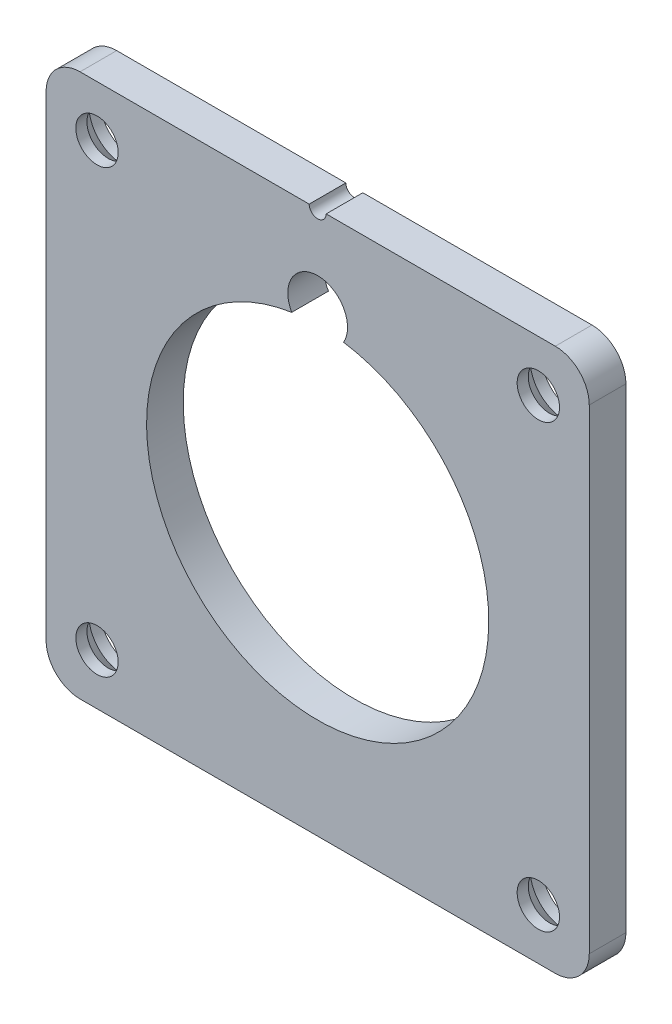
ISO-10303-21;
HEADER;
FILE_DESCRIPTION(('STEP AP214'),'2;1');
FILE_NAME('part.step','',(''),(''),'','','');
FILE_SCHEMA(('AUTOMOTIVE_DESIGN { 1 0 10303 214 1 1 1 1 }'));
ENDSEC;
DATA;
#1=APPLICATION_CONTEXT('core data for automotive mechanical design processes');
#2=APPLICATION_PROTOCOL_DEFINITION('international standard','automotive_design',2000,#1);
#3=PRODUCT_CONTEXT('',#1,'mechanical');
#4=PRODUCT('Part','Part','',(#3));
#5=PRODUCT_RELATED_PRODUCT_CATEGORY('part','',(#4));
#6=PRODUCT_DEFINITION_FORMATION('','',#4);
#7=PRODUCT_DEFINITION_CONTEXT('part definition',#1,'design');
#8=PRODUCT_DEFINITION('design','',#6,#7);
#9=PRODUCT_DEFINITION_SHAPE('','',#8);
#10=(LENGTH_UNIT() NAMED_UNIT(*) SI_UNIT(.MILLI.,.METRE.));
#11=(NAMED_UNIT(*) PLANE_ANGLE_UNIT() SI_UNIT($,.RADIAN.));
#12=(NAMED_UNIT(*) SI_UNIT($,.STERADIAN.) SOLID_ANGLE_UNIT());
#13=UNCERTAINTY_MEASURE_WITH_UNIT(LENGTH_MEASURE(1.E-05),#10,'distance_accuracy_value','');
#14=(GEOMETRIC_REPRESENTATION_CONTEXT(3) GLOBAL_UNCERTAINTY_ASSIGNED_CONTEXT((#13)) GLOBAL_UNIT_ASSIGNED_CONTEXT((#10,
#11,#12)) REPRESENTATION_CONTEXT('',''));
#15=CARTESIAN_POINT('',(0.,0.,0.));
#16=DIRECTION('',(0.,0.,1.));
#17=DIRECTION('',(1.,0.,0.));
#18=AXIS2_PLACEMENT_3D('',#15,#16,#17);
#19=CARTESIAN_POINT('',(-50.8,50.8,6.858));
#20=DIRECTION('',(0.,-1.,0.));
#21=DIRECTION('',(0.,0.,-1.));
#22=AXIS2_PLACEMENT_3D('',#19,#20,#21);
#23=PLANE('',#22);
#24=DIRECTION('',(-1.,0.,0.));
#25=VECTOR('',#24,1.);
#26=CARTESIAN_POINT('',(-50.8,50.8,6.858));
#27=LINE('',#26,#25);
#28=CARTESIAN_POINT('',(-1.5875,50.8,6.858));
#29=VERTEX_POINT('',#28);
#30=CARTESIAN_POINT('',(-44.45,50.8,6.858));
#31=VERTEX_POINT('',#30);
#32=EDGE_CURVE('E204',#29,#31,#27,.T.);
#33=ORIENTED_EDGE('',*,*,#32,.F.);
#34=DIRECTION('',(0.,0.,-1.));
#35=VECTOR('',#34,1.);
#36=CARTESIAN_POINT('',(-1.5875,50.8,6.858));
#37=LINE('',#36,#35);
#38=CARTESIAN_POINT('',(-1.5875,50.8,0.));
#39=VERTEX_POINT('',#38);
#40=EDGE_CURVE('E142',#29,#39,#37,.T.);
#41=ORIENTED_EDGE('',*,*,#40,.T.);
#42=DIRECTION('',(-1.,0.,0.));
#43=VECTOR('',#42,1.);
#44=CARTESIAN_POINT('',(-50.8,50.8,0.));
#45=LINE('',#44,#43);
#46=CARTESIAN_POINT('',(-44.45,50.8,0.));
#47=VERTEX_POINT('',#46);
#48=EDGE_CURVE('E217',#39,#47,#45,.T.);
#49=ORIENTED_EDGE('',*,*,#48,.T.);
#50=DIRECTION('',(0.,0.,-1.));
#51=VECTOR('',#50,1.);
#52=CARTESIAN_POINT('',(-44.45,50.8,6.858));
#53=LINE('',#52,#51);
#54=EDGE_CURVE('E251',#47,#31,#53,.F.);
#55=ORIENTED_EDGE('',*,*,#54,.T.);
#56=EDGE_LOOP('',(#33,#41,#49,#55));
#57=FACE_BOUND('',#56,.T.);
#58=ADVANCED_FACE('F32',(#57),#23,.F.);
#59=CARTESIAN_POINT('',(0.,0.,0.));
#60=DIRECTION('',(0.,0.,1.));
#61=DIRECTION('',(1.,0.,0.));
#62=AXIS2_PLACEMENT_3D('',#59,#60,#61);
#63=PLANE('',#62);
#64=CARTESIAN_POINT('',(0.,0.,0.));
#65=DIRECTION('',(0.,0.,-1.));
#66=DIRECTION('',(-1.,0.,0.));
#67=AXIS2_PLACEMENT_3D('',#64,#65,#66);
#68=CIRCLE('',#67,32.004);
#69=CARTESIAN_POINT('',(4.84622975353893,31.6349501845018,0.));
#70=VERTEX_POINT('',#69);
#71=CARTESIAN_POINT('',(-4.846229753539,31.6349501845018,0.));
#72=VERTEX_POINT('',#71);
#73=EDGE_CURVE('E131',#70,#72,#68,.T.);
#74=ORIENTED_EDGE('',*,*,#73,.F.);
#75=CARTESIAN_POINT('',(0.,34.417,0.));
#76=DIRECTION('',(0.,0.,-1.));
#77=DIRECTION('',(-1.,0.,0.));
#78=AXIS2_PLACEMENT_3D('',#75,#76,#77);
#79=CIRCLE('',#78,5.58799999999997);
#80=EDGE_CURVE('E47',#72,#70,#79,.T.);
#81=ORIENTED_EDGE('',*,*,#80,.F.);
#82=EDGE_LOOP('',(#74,#81));
#83=FACE_BOUND('',#82,.T.);
#84=CARTESIAN_POINT('',(41.275,41.275,0.));
#85=DIRECTION('',(0.,0.,-1.));
#86=DIRECTION('',(-1.,0.,0.));
#87=AXIS2_PLACEMENT_3D('',#84,#85,#86);
#88=CIRCLE('',#87,6.35);
#89=CARTESIAN_POINT('',(34.925,41.275,0.));
#90=VERTEX_POINT('',#89);
#91=EDGE_CURVE('E145',#90,#90,#88,.T.);
#92=ORIENTED_EDGE('',*,*,#91,.F.);
#93=EDGE_LOOP('',(#92));
#94=FACE_BOUND('',#93,.T.);
#95=CARTESIAN_POINT('',(-41.275,41.275,0.));
#96=DIRECTION('',(0.,0.,-1.));
#97=DIRECTION('',(-1.,0.,0.));
#98=AXIS2_PLACEMENT_3D('',#95,#96,#97);
#99=CIRCLE('',#98,6.35);
#100=CARTESIAN_POINT('',(-47.625,41.275,0.));
#101=VERTEX_POINT('',#100);
#102=EDGE_CURVE('E157',#101,#101,#99,.T.);
#103=ORIENTED_EDGE('',*,*,#102,.F.);
#104=EDGE_LOOP('',(#103));
#105=FACE_BOUND('',#104,.T.);
#106=CARTESIAN_POINT('',(41.275,-41.275,0.));
#107=DIRECTION('',(0.,0.,-1.));
#108=DIRECTION('',(-1.,0.,0.));
#109=AXIS2_PLACEMENT_3D('',#106,#107,#108);
#110=CIRCLE('',#109,6.35);
#111=CARTESIAN_POINT('',(34.925,-41.275,0.));
#112=VERTEX_POINT('',#111);
#113=EDGE_CURVE('E181',#112,#112,#110,.T.);
#114=ORIENTED_EDGE('',*,*,#113,.F.);
#115=EDGE_LOOP('',(#114));
#116=FACE_BOUND('',#115,.T.);
#117=ORIENTED_EDGE('',*,*,#48,.F.);
#118=CARTESIAN_POINT('',(0.,50.8,0.));
#119=DIRECTION('',(0.,0.,-1.));
#120=DIRECTION('',(-1.,0.,0.));
#121=AXIS2_PLACEMENT_3D('',#118,#119,#120);
#122=CIRCLE('',#121,1.5875);
#123=CARTESIAN_POINT('',(1.5875,50.8,0.));
#124=VERTEX_POINT('',#123);
#125=EDGE_CURVE('E136',#124,#39,#122,.T.);
#126=ORIENTED_EDGE('',*,*,#125,.F.);
#127=CARTESIAN_POINT('',(44.45,50.8,0.));
#128=VERTEX_POINT('',#127);
#129=EDGE_CURVE('E198',#128,#124,#45,.T.);
#130=ORIENTED_EDGE('',*,*,#129,.F.);
#131=CARTESIAN_POINT('',(44.45,44.45,0.));
#132=DIRECTION('',(0.,0.,1.));
#133=DIRECTION('',(1.,0.,0.));
#134=AXIS2_PLACEMENT_3D('',#131,#132,#133);
#135=CIRCLE('',#134,6.35);
#136=CARTESIAN_POINT('',(50.8,44.45,0.));
#137=VERTEX_POINT('',#136);
#138=EDGE_CURVE('E227',#128,#137,#135,.F.);
#139=ORIENTED_EDGE('',*,*,#138,.T.);
#140=DIRECTION('',(0.,1.,0.));
#141=VECTOR('',#140,1.);
#142=CARTESIAN_POINT('',(50.8,50.8,0.));
#143=LINE('',#142,#141);
#144=CARTESIAN_POINT('',(50.8,-44.45,0.));
#145=VERTEX_POINT('',#144);
#146=EDGE_CURVE('E214',#145,#137,#143,.T.);
#147=ORIENTED_EDGE('',*,*,#146,.F.);
#148=CARTESIAN_POINT('',(44.45,-44.45,0.));
#149=DIRECTION('',(0.,0.,1.));
#150=DIRECTION('',(1.,0.,0.));
#151=AXIS2_PLACEMENT_3D('',#148,#149,#150);
#152=CIRCLE('',#151,6.35);
#153=CARTESIAN_POINT('',(44.45,-50.8,0.));
#154=VERTEX_POINT('',#153);
#155=EDGE_CURVE('E229',#145,#154,#152,.F.);
#156=ORIENTED_EDGE('',*,*,#155,.T.);
#157=DIRECTION('',(1.,0.,0.));
#158=VECTOR('',#157,1.);
#159=CARTESIAN_POINT('',(-50.8,-50.8,0.));
#160=LINE('',#159,#158);
#161=CARTESIAN_POINT('',(-44.45,-50.8,0.));
#162=VERTEX_POINT('',#161);
#163=EDGE_CURVE('E211',#162,#154,#160,.T.);
#164=ORIENTED_EDGE('',*,*,#163,.F.);
#165=CARTESIAN_POINT('',(-44.45,-44.45,0.));
#166=DIRECTION('',(0.,0.,1.));
#167=DIRECTION('',(1.,0.,0.));
#168=AXIS2_PLACEMENT_3D('',#165,#166,#167);
#169=CIRCLE('',#168,6.35);
#170=CARTESIAN_POINT('',(-50.8,-44.45,0.));
#171=VERTEX_POINT('',#170);
#172=EDGE_CURVE('E231',#162,#171,#169,.F.);
#173=ORIENTED_EDGE('',*,*,#172,.T.);
#174=DIRECTION('',(0.,-1.,0.));
#175=VECTOR('',#174,1.);
#176=CARTESIAN_POINT('',(-50.8,50.8,0.));
#177=LINE('',#176,#175);
#178=CARTESIAN_POINT('',(-50.8,44.45,0.));
#179=VERTEX_POINT('',#178);
#180=EDGE_CURVE('E193',#179,#171,#177,.T.);
#181=ORIENTED_EDGE('',*,*,#180,.F.);
#182=CARTESIAN_POINT('',(-44.45,44.45,0.));
#183=DIRECTION('',(0.,0.,1.));
#184=DIRECTION('',(1.,0.,0.));
#185=AXIS2_PLACEMENT_3D('',#182,#183,#184);
#186=CIRCLE('',#185,6.35);
#187=EDGE_CURVE('E224',#179,#47,#186,.F.);
#188=ORIENTED_EDGE('',*,*,#187,.T.);
#189=EDGE_LOOP('',(#117,#126,#130,#139,#147,#156,#164,#173,#181,#188));
#190=FACE_BOUND('',#189,.T.);
#191=CARTESIAN_POINT('',(-41.275,-41.275,0.));
#192=DIRECTION('',(0.,0.,-1.));
#193=DIRECTION('',(-1.,0.,0.));
#194=AXIS2_PLACEMENT_3D('',#191,#192,#193);
#195=CIRCLE('',#194,6.35);
#196=CARTESIAN_POINT('',(-47.625,-41.275,0.));
#197=VERTEX_POINT('',#196);
#198=EDGE_CURVE('E169',#197,#197,#195,.T.);
#199=ORIENTED_EDGE('',*,*,#198,.F.);
#200=EDGE_LOOP('',(#199));
#201=FACE_BOUND('',#200,.T.);
#202=ADVANCED_FACE('F264',(#83,#94,#105,#116,#190,#201),#63,.F.);
#203=CARTESIAN_POINT('',(-50.8,50.8,6.858));
#204=DIRECTION('',(1.,0.,0.));
#205=DIRECTION('',(0.,1.,0.));
#206=AXIS2_PLACEMENT_3D('',#203,#204,#205);
#207=PLANE('',#206);
#208=ORIENTED_EDGE('',*,*,#180,.T.);
#209=DIRECTION('',(0.,0.,-1.));
#210=VECTOR('',#209,1.);
#211=CARTESIAN_POINT('',(-50.8,-44.45,6.858));
#212=LINE('',#211,#210);
#213=CARTESIAN_POINT('',(-50.8,-44.45,6.858));
#214=VERTEX_POINT('',#213);
#215=EDGE_CURVE('E236',#171,#214,#212,.F.);
#216=ORIENTED_EDGE('',*,*,#215,.T.);
#217=DIRECTION('',(0.,-1.,0.));
#218=VECTOR('',#217,1.);
#219=CARTESIAN_POINT('',(-50.8,50.8,6.858));
#220=LINE('',#219,#218);
#221=CARTESIAN_POINT('',(-50.8,44.45,6.858));
#222=VERTEX_POINT('',#221);
#223=EDGE_CURVE('E194',#222,#214,#220,.T.);
#224=ORIENTED_EDGE('',*,*,#223,.F.);
#225=DIRECTION('',(0.,0.,-1.));
#226=VECTOR('',#225,1.);
#227=CARTESIAN_POINT('',(-50.8,44.45,6.858));
#228=LINE('',#227,#226);
#229=EDGE_CURVE('E233',#222,#179,#228,.T.);
#230=ORIENTED_EDGE('',*,*,#229,.T.);
#231=EDGE_LOOP('',(#208,#216,#224,#230));
#232=FACE_BOUND('',#231,.T.);
#233=ADVANCED_FACE('F297',(#232),#207,.F.);
#234=CARTESIAN_POINT('',(-50.8,-50.8,6.858));
#235=DIRECTION('',(0.,1.,0.));
#236=DIRECTION('',(0.,0.,1.));
#237=AXIS2_PLACEMENT_3D('',#234,#235,#236);
#238=PLANE('',#237);
#239=DIRECTION('',(1.,0.,0.));
#240=VECTOR('',#239,1.);
#241=CARTESIAN_POINT('',(-50.8,-50.8,6.858));
#242=LINE('',#241,#240);
#243=CARTESIAN_POINT('',(-44.45,-50.8,6.858));
#244=VERTEX_POINT('',#243);
#245=CARTESIAN_POINT('',(44.45,-50.8,6.858));
#246=VERTEX_POINT('',#245);
#247=EDGE_CURVE('E197',#244,#246,#242,.T.);
#248=ORIENTED_EDGE('',*,*,#247,.F.);
#249=DIRECTION('',(0.,0.,-1.));
#250=VECTOR('',#249,1.);
#251=CARTESIAN_POINT('',(-44.45,-50.8,6.858));
#252=LINE('',#251,#250);
#253=EDGE_CURVE('E221',#244,#162,#252,.T.);
#254=ORIENTED_EDGE('',*,*,#253,.T.);
#255=ORIENTED_EDGE('',*,*,#163,.T.);
#256=DIRECTION('',(0.,0.,-1.));
#257=VECTOR('',#256,1.);
#258=CARTESIAN_POINT('',(44.45,-50.8,6.858));
#259=LINE('',#258,#257);
#260=EDGE_CURVE('E208',#154,#246,#259,.F.);
#261=ORIENTED_EDGE('',*,*,#260,.T.);
#262=EDGE_LOOP('',(#248,#254,#255,#261));
#263=FACE_BOUND('',#262,.T.);
#264=ADVANCED_FACE('F287',(#263),#238,.F.);
#265=CARTESIAN_POINT('',(50.8,50.8,6.858));
#266=DIRECTION('',(-1.,0.,0.));
#267=DIRECTION('',(0.,0.,1.));
#268=AXIS2_PLACEMENT_3D('',#265,#266,#267);
#269=PLANE('',#268);
#270=DIRECTION('',(0.,1.,0.));
#271=VECTOR('',#270,1.);
#272=CARTESIAN_POINT('',(50.8,50.8,6.858));
#273=LINE('',#272,#271);
#274=CARTESIAN_POINT('',(50.8,-44.45,6.858));
#275=VERTEX_POINT('',#274);
#276=CARTESIAN_POINT('',(50.8,44.45,6.858));
#277=VERTEX_POINT('',#276);
#278=EDGE_CURVE('E201',#275,#277,#273,.T.);
#279=ORIENTED_EDGE('',*,*,#278,.F.);
#280=DIRECTION('',(0.,0.,-1.));
#281=VECTOR('',#280,1.);
#282=CARTESIAN_POINT('',(50.8,-44.45,6.858));
#283=LINE('',#282,#281);
#284=EDGE_CURVE('E248',#275,#145,#283,.T.);
#285=ORIENTED_EDGE('',*,*,#284,.T.);
#286=ORIENTED_EDGE('',*,*,#146,.T.);
#287=DIRECTION('',(0.,0.,-1.));
#288=VECTOR('',#287,1.);
#289=CARTESIAN_POINT('',(50.8,44.45,6.858));
#290=LINE('',#289,#288);
#291=EDGE_CURVE('E246',#137,#277,#290,.F.);
#292=ORIENTED_EDGE('',*,*,#291,.T.);
#293=EDGE_LOOP('',(#279,#285,#286,#292));
#294=FACE_BOUND('',#293,.T.);
#295=ADVANCED_FACE('F280',(#294),#269,.F.);
#296=ORIENTED_EDGE('',*,*,#129,.T.);
#297=DIRECTION('',(0.,0.,-1.));
#298=VECTOR('',#297,1.);
#299=CARTESIAN_POINT('',(1.5875,50.8,6.858));
#300=LINE('',#299,#298);
#301=CARTESIAN_POINT('',(1.5875,50.8,6.858));
#302=VERTEX_POINT('',#301);
#303=EDGE_CURVE('E139',#124,#302,#300,.F.);
#304=ORIENTED_EDGE('',*,*,#303,.T.);
#305=CARTESIAN_POINT('',(44.45,50.8,6.858));
#306=VERTEX_POINT('',#305);
#307=EDGE_CURVE('E205',#306,#302,#27,.T.);
#308=ORIENTED_EDGE('',*,*,#307,.F.);
#309=DIRECTION('',(0.,0.,-1.));
#310=VECTOR('',#309,1.);
#311=CARTESIAN_POINT('',(44.45,50.8,6.858));
#312=LINE('',#311,#310);
#313=EDGE_CURVE('E40',#306,#128,#312,.T.);
#314=ORIENTED_EDGE('',*,*,#313,.T.);
#315=EDGE_LOOP('',(#296,#304,#308,#314));
#316=FACE_BOUND('',#315,.T.);
#317=ADVANCED_FACE('F258',(#316),#23,.F.);
#318=CARTESIAN_POINT('',(0.,0.,6.858));
#319=DIRECTION('',(0.,0.,1.));
#320=DIRECTION('',(1.,0.,0.));
#321=AXIS2_PLACEMENT_3D('',#318,#319,#320);
#322=PLANE('',#321);
#323=CARTESIAN_POINT('',(0.,34.417,6.858));
#324=DIRECTION('',(0.,0.,-1.));
#325=DIRECTION('',(-1.,0.,0.));
#326=AXIS2_PLACEMENT_3D('',#323,#324,#325);
#327=CIRCLE('',#326,5.58799999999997);
#328=CARTESIAN_POINT('',(-4.846229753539,31.6349501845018,6.858));
#329=VERTEX_POINT('',#328);
#330=CARTESIAN_POINT('',(4.84622975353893,31.6349501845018,6.858));
#331=VERTEX_POINT('',#330);
#332=EDGE_CURVE('E52',#329,#331,#327,.T.);
#333=ORIENTED_EDGE('',*,*,#332,.T.);
#334=CARTESIAN_POINT('',(0.,0.,6.858));
#335=DIRECTION('',(0.,0.,-1.));
#336=DIRECTION('',(-1.,0.,0.));
#337=AXIS2_PLACEMENT_3D('',#334,#335,#336);
#338=CIRCLE('',#337,32.004);
#339=EDGE_CURVE('E123',#331,#329,#338,.T.);
#340=ORIENTED_EDGE('',*,*,#339,.T.);
#341=EDGE_LOOP('',(#333,#340));
#342=FACE_BOUND('',#341,.T.);
#343=CARTESIAN_POINT('',(0.,50.8,6.858));
#344=DIRECTION('',(0.,0.,1.));
#345=DIRECTION('',(1.,0.,0.));
#346=AXIS2_PLACEMENT_3D('',#343,#344,#345);
#347=CIRCLE('',#346,1.5875);
#348=EDGE_CURVE('E11',#29,#302,#347,.T.);
#349=ORIENTED_EDGE('',*,*,#348,.F.);
#350=ORIENTED_EDGE('',*,*,#32,.T.);
#351=CARTESIAN_POINT('',(-44.45,44.45,6.858));
#352=DIRECTION('',(0.,0.,1.));
#353=DIRECTION('',(1.,0.,0.));
#354=AXIS2_PLACEMENT_3D('',#351,#352,#353);
#355=CIRCLE('',#354,6.35);
#356=EDGE_CURVE('E238',#31,#222,#355,.T.);
#357=ORIENTED_EDGE('',*,*,#356,.T.);
#358=ORIENTED_EDGE('',*,*,#223,.T.);
#359=CARTESIAN_POINT('',(-44.45,-44.45,6.858));
#360=DIRECTION('',(0.,0.,1.));
#361=DIRECTION('',(1.,0.,0.));
#362=AXIS2_PLACEMENT_3D('',#359,#360,#361);
#363=CIRCLE('',#362,6.35);
#364=EDGE_CURVE('E244',#214,#244,#363,.T.);
#365=ORIENTED_EDGE('',*,*,#364,.T.);
#366=ORIENTED_EDGE('',*,*,#247,.T.);
#367=CARTESIAN_POINT('',(44.45,-44.45,6.858));
#368=DIRECTION('',(0.,0.,1.));
#369=DIRECTION('',(1.,0.,0.));
#370=AXIS2_PLACEMENT_3D('',#367,#368,#369);
#371=CIRCLE('',#370,6.35);
#372=EDGE_CURVE('E242',#246,#275,#371,.T.);
#373=ORIENTED_EDGE('',*,*,#372,.T.);
#374=ORIENTED_EDGE('',*,*,#278,.T.);
#375=CARTESIAN_POINT('',(44.45,44.45,6.858));
#376=DIRECTION('',(0.,0.,1.));
#377=DIRECTION('',(1.,0.,0.));
#378=AXIS2_PLACEMENT_3D('',#375,#376,#377);
#379=CIRCLE('',#378,6.35);
#380=EDGE_CURVE('E240',#277,#306,#379,.T.);
#381=ORIENTED_EDGE('',*,*,#380,.T.);
#382=ORIENTED_EDGE('',*,*,#307,.T.);
#383=EDGE_LOOP('',(#349,#350,#357,#358,#365,#366,#373,#374,#381,#382));
#384=FACE_BOUND('',#383,.T.);
#385=CARTESIAN_POINT('',(41.275,41.275,6.858));
#386=DIRECTION('',(0.,0.,1.));
#387=DIRECTION('',(1.,0.,0.));
#388=AXIS2_PLACEMENT_3D('',#385,#386,#387);
#389=CIRCLE('',#388,3.9624);
#390=CARTESIAN_POINT('',(45.2374,41.275,6.858));
#391=VERTEX_POINT('',#390);
#392=EDGE_CURVE('E154',#391,#391,#389,.T.);
#393=ORIENTED_EDGE('',*,*,#392,.F.);
#394=EDGE_LOOP('',(#393));
#395=FACE_BOUND('',#394,.T.);
#396=CARTESIAN_POINT('',(-41.275,41.275,6.858));
#397=DIRECTION('',(0.,0.,1.));
#398=DIRECTION('',(1.,0.,0.));
#399=AXIS2_PLACEMENT_3D('',#396,#397,#398);
#400=CIRCLE('',#399,3.9624);
#401=CARTESIAN_POINT('',(-37.3126,41.275,6.858));
#402=VERTEX_POINT('',#401);
#403=EDGE_CURVE('E166',#402,#402,#400,.T.);
#404=ORIENTED_EDGE('',*,*,#403,.F.);
#405=EDGE_LOOP('',(#404));
#406=FACE_BOUND('',#405,.T.);
#407=CARTESIAN_POINT('',(-41.275,-41.275,6.858));
#408=DIRECTION('',(0.,0.,1.));
#409=DIRECTION('',(1.,0.,0.));
#410=AXIS2_PLACEMENT_3D('',#407,#408,#409);
#411=CIRCLE('',#410,3.9624);
#412=CARTESIAN_POINT('',(-37.3126,-41.275,6.858));
#413=VERTEX_POINT('',#412);
#414=EDGE_CURVE('E178',#413,#413,#411,.T.);
#415=ORIENTED_EDGE('',*,*,#414,.F.);
#416=EDGE_LOOP('',(#415));
#417=FACE_BOUND('',#416,.T.);
#418=CARTESIAN_POINT('',(41.275,-41.275,6.858));
#419=DIRECTION('',(0.,0.,1.));
#420=DIRECTION('',(1.,0.,0.));
#421=AXIS2_PLACEMENT_3D('',#418,#419,#420);
#422=CIRCLE('',#421,3.9624);
#423=CARTESIAN_POINT('',(45.2374,-41.275,6.858));
#424=VERTEX_POINT('',#423);
#425=EDGE_CURVE('E190',#424,#424,#422,.T.);
#426=ORIENTED_EDGE('',*,*,#425,.F.);
#427=EDGE_LOOP('',(#426));
#428=FACE_BOUND('',#427,.T.);
#429=ADVANCED_FACE('F129',(#342,#384,#395,#406,#417,#428),#322,.T.);
#430=CARTESIAN_POINT('',(-44.45,-44.45,6.858));
#431=DIRECTION('',(0.,0.,-1.));
#432=DIRECTION('',(-1.,0.,0.));
#433=AXIS2_PLACEMENT_3D('',#430,#431,#432);
#434=CYLINDRICAL_SURFACE('',#433,6.35);
#435=ORIENTED_EDGE('',*,*,#364,.F.);
#436=ORIENTED_EDGE('',*,*,#215,.F.);
#437=ORIENTED_EDGE('',*,*,#172,.F.);
#438=ORIENTED_EDGE('',*,*,#253,.F.);
#439=EDGE_LOOP('',(#435,#436,#437,#438));
#440=FACE_BOUND('',#439,.T.);
#441=ADVANCED_FACE('F293',(#440),#434,.T.);
#442=CARTESIAN_POINT('',(44.45,-44.45,6.858));
#443=DIRECTION('',(0.,0.,-1.));
#444=DIRECTION('',(-1.,0.,0.));
#445=AXIS2_PLACEMENT_3D('',#442,#443,#444);
#446=CYLINDRICAL_SURFACE('',#445,6.35);
#447=ORIENTED_EDGE('',*,*,#372,.F.);
#448=ORIENTED_EDGE('',*,*,#260,.F.);
#449=ORIENTED_EDGE('',*,*,#155,.F.);
#450=ORIENTED_EDGE('',*,*,#284,.F.);
#451=EDGE_LOOP('',(#447,#448,#449,#450));
#452=FACE_BOUND('',#451,.T.);
#453=ADVANCED_FACE('F290',(#452),#446,.T.);
#454=CARTESIAN_POINT('',(44.45,44.45,6.858));
#455=DIRECTION('',(0.,0.,-1.));
#456=DIRECTION('',(-1.,0.,0.));
#457=AXIS2_PLACEMENT_3D('',#454,#455,#456);
#458=CYLINDRICAL_SURFACE('',#457,6.35);
#459=ORIENTED_EDGE('',*,*,#380,.F.);
#460=ORIENTED_EDGE('',*,*,#291,.F.);
#461=ORIENTED_EDGE('',*,*,#138,.F.);
#462=ORIENTED_EDGE('',*,*,#313,.F.);
#463=EDGE_LOOP('',(#459,#460,#461,#462));
#464=FACE_BOUND('',#463,.T.);
#465=ADVANCED_FACE('F278',(#464),#458,.T.);
#466=CARTESIAN_POINT('',(-44.45,44.45,6.858));
#467=DIRECTION('',(0.,0.,-1.));
#468=DIRECTION('',(-1.,0.,0.));
#469=AXIS2_PLACEMENT_3D('',#466,#467,#468);
#470=CYLINDRICAL_SURFACE('',#469,6.35);
#471=ORIENTED_EDGE('',*,*,#356,.F.);
#472=ORIENTED_EDGE('',*,*,#54,.F.);
#473=ORIENTED_EDGE('',*,*,#187,.F.);
#474=ORIENTED_EDGE('',*,*,#229,.F.);
#475=EDGE_LOOP('',(#471,#472,#473,#474));
#476=FACE_BOUND('',#475,.T.);
#477=ADVANCED_FACE('F34',(#476),#470,.T.);
#478=CARTESIAN_POINT('',(41.275,-41.275,0.));
#479=DIRECTION('',(0.,0.,-1.));
#480=DIRECTION('',(-1.,0.,0.));
#481=AXIS2_PLACEMENT_3D('',#478,#479,#480);
#482=CYLINDRICAL_SURFACE('',#481,3.9624);
#483=CARTESIAN_POINT('',(41.275,-41.275,4.77861960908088));
#484=DIRECTION('',(0.,0.,-1.));
#485=DIRECTION('',(-1.,0.,0.));
#486=AXIS2_PLACEMENT_3D('',#483,#484,#485);
#487=CIRCLE('',#486,3.9624);
#488=CARTESIAN_POINT('',(37.3126,-41.275,4.77861960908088));
#489=VERTEX_POINT('',#488);
#490=EDGE_CURVE('E187',#489,#489,#487,.T.);
#491=ORIENTED_EDGE('',*,*,#490,.T.);
#492=EDGE_LOOP('',(#491));
#493=FACE_BOUND('',#492,.T.);
#494=ORIENTED_EDGE('',*,*,#425,.T.);
#495=EDGE_LOOP('',(#494));
#496=FACE_BOUND('',#495,.T.);
#497=ADVANCED_FACE('F301',(#493,#496),#482,.F.);
#498=CARTESIAN_POINT('',(41.275,-41.275,2.032));
#499=DIRECTION('',(0.,0.,-1.));
#500=DIRECTION('',(-1.,0.,0.));
#501=AXIS2_PLACEMENT_3D('',#498,#499,#500);
#502=CONICAL_SURFACE('',#501,6.35,0.715584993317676);
#503=ORIENTED_EDGE('',*,*,#490,.F.);
#504=EDGE_LOOP('',(#503));
#505=FACE_BOUND('',#504,.T.);
#506=CARTESIAN_POINT('',(41.275,-41.275,2.032));
#507=DIRECTION('',(0.,0.,-1.));
#508=DIRECTION('',(-1.,0.,0.));
#509=AXIS2_PLACEMENT_3D('',#506,#507,#508);
#510=CIRCLE('',#509,6.35);
#511=CARTESIAN_POINT('',(34.925,-41.275,2.032));
#512=VERTEX_POINT('',#511);
#513=EDGE_CURVE('E184',#512,#512,#510,.T.);
#514=ORIENTED_EDGE('',*,*,#513,.T.);
#515=EDGE_LOOP('',(#514));
#516=FACE_BOUND('',#515,.T.);
#517=ADVANCED_FACE('F306',(#505,#516),#502,.F.);
#518=CARTESIAN_POINT('',(41.275,-41.275,0.));
#519=DIRECTION('',(0.,0.,-1.));
#520=DIRECTION('',(-1.,0.,0.));
#521=AXIS2_PLACEMENT_3D('',#518,#519,#520);
#522=CYLINDRICAL_SURFACE('',#521,6.35);
#523=ORIENTED_EDGE('',*,*,#513,.F.);
#524=EDGE_LOOP('',(#523));
#525=FACE_BOUND('',#524,.T.);
#526=ORIENTED_EDGE('',*,*,#113,.T.);
#527=EDGE_LOOP('',(#526));
#528=FACE_BOUND('',#527,.T.);
#529=ADVANCED_FACE('F361',(#525,#528),#522,.F.);
#530=CARTESIAN_POINT('',(-41.275,-41.275,0.));
#531=DIRECTION('',(0.,0.,-1.));
#532=DIRECTION('',(-1.,0.,0.));
#533=AXIS2_PLACEMENT_3D('',#530,#531,#532);
#534=CYLINDRICAL_SURFACE('',#533,3.9624);
#535=CARTESIAN_POINT('',(-41.275,-41.275,4.77861960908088));
#536=DIRECTION('',(0.,0.,-1.));
#537=DIRECTION('',(-1.,0.,0.));
#538=AXIS2_PLACEMENT_3D('',#535,#536,#537);
#539=CIRCLE('',#538,3.9624);
#540=CARTESIAN_POINT('',(-45.2374,-41.275,4.77861960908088));
#541=VERTEX_POINT('',#540);
#542=EDGE_CURVE('E175',#541,#541,#539,.T.);
#543=ORIENTED_EDGE('',*,*,#542,.T.);
#544=EDGE_LOOP('',(#543));
#545=FACE_BOUND('',#544,.T.);
#546=ORIENTED_EDGE('',*,*,#414,.T.);
#547=EDGE_LOOP('',(#546));
#548=FACE_BOUND('',#547,.T.);
#549=ADVANCED_FACE('F371',(#545,#548),#534,.F.);
#550=CARTESIAN_POINT('',(-41.275,-41.275,2.032));
#551=DIRECTION('',(0.,0.,-1.));
#552=DIRECTION('',(-1.,0.,0.));
#553=AXIS2_PLACEMENT_3D('',#550,#551,#552);
#554=CONICAL_SURFACE('',#553,6.35,0.715584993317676);
#555=ORIENTED_EDGE('',*,*,#542,.F.);
#556=EDGE_LOOP('',(#555));
#557=FACE_BOUND('',#556,.T.);
#558=CARTESIAN_POINT('',(-41.275,-41.275,2.032));
#559=DIRECTION('',(0.,0.,-1.));
#560=DIRECTION('',(-1.,0.,0.));
#561=AXIS2_PLACEMENT_3D('',#558,#559,#560);
#562=CIRCLE('',#561,6.35);
#563=CARTESIAN_POINT('',(-47.625,-41.275,2.032));
#564=VERTEX_POINT('',#563);
#565=EDGE_CURVE('E172',#564,#564,#562,.T.);
#566=ORIENTED_EDGE('',*,*,#565,.T.);
#567=EDGE_LOOP('',(#566));
#568=FACE_BOUND('',#567,.T.);
#569=ADVANCED_FACE('F381',(#557,#568),#554,.F.);
#570=CARTESIAN_POINT('',(-41.275,-41.275,0.));
#571=DIRECTION('',(0.,0.,-1.));
#572=DIRECTION('',(-1.,0.,0.));
#573=AXIS2_PLACEMENT_3D('',#570,#571,#572);
#574=CYLINDRICAL_SURFACE('',#573,6.35);
#575=ORIENTED_EDGE('',*,*,#565,.F.);
#576=EDGE_LOOP('',(#575));
#577=FACE_BOUND('',#576,.T.);
#578=ORIENTED_EDGE('',*,*,#198,.T.);
#579=EDGE_LOOP('',(#578));
#580=FACE_BOUND('',#579,.T.);
#581=ADVANCED_FACE('F391',(#577,#580),#574,.F.);
#582=CARTESIAN_POINT('',(-41.275,41.275,0.));
#583=DIRECTION('',(0.,0.,-1.));
#584=DIRECTION('',(-1.,0.,0.));
#585=AXIS2_PLACEMENT_3D('',#582,#583,#584);
#586=CYLINDRICAL_SURFACE('',#585,3.9624);
#587=CARTESIAN_POINT('',(-41.275,41.275,4.77861960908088));
#588=DIRECTION('',(0.,0.,-1.));
#589=DIRECTION('',(-1.,0.,0.));
#590=AXIS2_PLACEMENT_3D('',#587,#588,#589);
#591=CIRCLE('',#590,3.9624);
#592=CARTESIAN_POINT('',(-45.2374,41.275,4.77861960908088));
#593=VERTEX_POINT('',#592);
#594=EDGE_CURVE('E163',#593,#593,#591,.T.);
#595=ORIENTED_EDGE('',*,*,#594,.T.);
#596=EDGE_LOOP('',(#595));
#597=FACE_BOUND('',#596,.T.);
#598=ORIENTED_EDGE('',*,*,#403,.T.);
#599=EDGE_LOOP('',(#598));
#600=FACE_BOUND('',#599,.T.);
#601=ADVANCED_FACE('F401',(#597,#600),#586,.F.);
#602=CARTESIAN_POINT('',(-41.275,41.275,2.032));
#603=DIRECTION('',(0.,0.,-1.));
#604=DIRECTION('',(-1.,0.,0.));
#605=AXIS2_PLACEMENT_3D('',#602,#603,#604);
#606=CONICAL_SURFACE('',#605,6.35,0.715584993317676);
#607=ORIENTED_EDGE('',*,*,#594,.F.);
#608=EDGE_LOOP('',(#607));
#609=FACE_BOUND('',#608,.T.);
#610=CARTESIAN_POINT('',(-41.275,41.275,2.032));
#611=DIRECTION('',(0.,0.,-1.));
#612=DIRECTION('',(-1.,0.,0.));
#613=AXIS2_PLACEMENT_3D('',#610,#611,#612);
#614=CIRCLE('',#613,6.35);
#615=CARTESIAN_POINT('',(-47.625,41.275,2.032));
#616=VERTEX_POINT('',#615);
#617=EDGE_CURVE('E160',#616,#616,#614,.T.);
#618=ORIENTED_EDGE('',*,*,#617,.T.);
#619=EDGE_LOOP('',(#618));
#620=FACE_BOUND('',#619,.T.);
#621=ADVANCED_FACE('F411',(#609,#620),#606,.F.);
#622=CARTESIAN_POINT('',(-41.275,41.275,0.));
#623=DIRECTION('',(0.,0.,-1.));
#624=DIRECTION('',(-1.,0.,0.));
#625=AXIS2_PLACEMENT_3D('',#622,#623,#624);
#626=CYLINDRICAL_SURFACE('',#625,6.35);
#627=ORIENTED_EDGE('',*,*,#617,.F.);
#628=EDGE_LOOP('',(#627));
#629=FACE_BOUND('',#628,.T.);
#630=ORIENTED_EDGE('',*,*,#102,.T.);
#631=EDGE_LOOP('',(#630));
#632=FACE_BOUND('',#631,.T.);
#633=ADVANCED_FACE('F421',(#629,#632),#626,.F.);
#634=CARTESIAN_POINT('',(41.275,41.275,0.));
#635=DIRECTION('',(0.,0.,-1.));
#636=DIRECTION('',(-1.,0.,0.));
#637=AXIS2_PLACEMENT_3D('',#634,#635,#636);
#638=CYLINDRICAL_SURFACE('',#637,3.9624);
#639=CARTESIAN_POINT('',(41.275,41.275,4.77861960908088));
#640=DIRECTION('',(0.,0.,-1.));
#641=DIRECTION('',(-1.,0.,0.));
#642=AXIS2_PLACEMENT_3D('',#639,#640,#641);
#643=CIRCLE('',#642,3.9624);
#644=CARTESIAN_POINT('',(37.3126,41.275,4.77861960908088));
#645=VERTEX_POINT('',#644);
#646=EDGE_CURVE('E151',#645,#645,#643,.T.);
#647=ORIENTED_EDGE('',*,*,#646,.T.);
#648=EDGE_LOOP('',(#647));
#649=FACE_BOUND('',#648,.T.);
#650=ORIENTED_EDGE('',*,*,#392,.T.);
#651=EDGE_LOOP('',(#650));
#652=FACE_BOUND('',#651,.T.);
#653=ADVANCED_FACE('F431',(#649,#652),#638,.F.);
#654=CARTESIAN_POINT('',(41.275,41.275,2.032));
#655=DIRECTION('',(0.,0.,-1.));
#656=DIRECTION('',(-1.,0.,0.));
#657=AXIS2_PLACEMENT_3D('',#654,#655,#656);
#658=CONICAL_SURFACE('',#657,6.35,0.715584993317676);
#659=ORIENTED_EDGE('',*,*,#646,.F.);
#660=EDGE_LOOP('',(#659));
#661=FACE_BOUND('',#660,.T.);
#662=CARTESIAN_POINT('',(41.275,41.275,2.032));
#663=DIRECTION('',(0.,0.,-1.));
#664=DIRECTION('',(-1.,0.,0.));
#665=AXIS2_PLACEMENT_3D('',#662,#663,#664);
#666=CIRCLE('',#665,6.35);
#667=CARTESIAN_POINT('',(34.925,41.275,2.032));
#668=VERTEX_POINT('',#667);
#669=EDGE_CURVE('E148',#668,#668,#666,.T.);
#670=ORIENTED_EDGE('',*,*,#669,.T.);
#671=EDGE_LOOP('',(#670));
#672=FACE_BOUND('',#671,.T.);
#673=ADVANCED_FACE('F441',(#661,#672),#658,.F.);
#674=CARTESIAN_POINT('',(41.275,41.275,0.));
#675=DIRECTION('',(0.,0.,-1.));
#676=DIRECTION('',(-1.,0.,0.));
#677=AXIS2_PLACEMENT_3D('',#674,#675,#676);
#678=CYLINDRICAL_SURFACE('',#677,6.35);
#679=ORIENTED_EDGE('',*,*,#669,.F.);
#680=EDGE_LOOP('',(#679));
#681=FACE_BOUND('',#680,.T.);
#682=ORIENTED_EDGE('',*,*,#91,.T.);
#683=EDGE_LOOP('',(#682));
#684=FACE_BOUND('',#683,.T.);
#685=ADVANCED_FACE('F451',(#681,#684),#678,.F.);
#686=CARTESIAN_POINT('',(0.,50.8,6.858));
#687=DIRECTION('',(0.,0.,-1.));
#688=DIRECTION('',(-1.,0.,0.));
#689=AXIS2_PLACEMENT_3D('',#686,#687,#688);
#690=CYLINDRICAL_SURFACE('',#689,1.5875);
#691=ORIENTED_EDGE('',*,*,#348,.T.);
#692=ORIENTED_EDGE('',*,*,#303,.F.);
#693=ORIENTED_EDGE('',*,*,#125,.T.);
#694=ORIENTED_EDGE('',*,*,#40,.F.);
#695=EDGE_LOOP('',(#691,#692,#693,#694));
#696=FACE_BOUND('',#695,.T.);
#697=ADVANCED_FACE('F268',(#696),#690,.F.);
#698=CARTESIAN_POINT('',(0.,34.417,6.858));
#699=DIRECTION('',(0.,0.,-1.));
#700=DIRECTION('',(-1.,0.,0.));
#701=AXIS2_PLACEMENT_3D('',#698,#699,#700);
#702=CYLINDRICAL_SURFACE('',#701,5.58799999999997);
#703=ORIENTED_EDGE('',*,*,#80,.T.);
#704=DIRECTION('',(0.,0.,-1.));
#705=VECTOR('',#704,1.);
#706=CARTESIAN_POINT('',(4.84622975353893,31.6349501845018,6.858));
#707=LINE('',#706,#705);
#708=EDGE_CURVE('E116',#331,#70,#707,.T.);
#709=ORIENTED_EDGE('',*,*,#708,.F.);
#710=ORIENTED_EDGE('',*,*,#332,.F.);
#711=DIRECTION('',(0.,0.,-1.));
#712=VECTOR('',#711,1.);
#713=CARTESIAN_POINT('',(-4.846229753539,31.6349501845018,6.858));
#714=LINE('',#713,#712);
#715=EDGE_CURVE('E122',#329,#72,#714,.T.);
#716=ORIENTED_EDGE('',*,*,#715,.T.);
#717=EDGE_LOOP('',(#703,#709,#710,#716));
#718=FACE_BOUND('',#717,.T.);
#719=ADVANCED_FACE('F118',(#718),#702,.F.);
#720=CARTESIAN_POINT('',(0.,0.,6.858));
#721=DIRECTION('',(0.,0.,-1.));
#722=DIRECTION('',(-1.,0.,0.));
#723=AXIS2_PLACEMENT_3D('',#720,#721,#722);
#724=CYLINDRICAL_SURFACE('',#723,32.004);
#725=ORIENTED_EDGE('',*,*,#73,.T.);
#726=ORIENTED_EDGE('',*,*,#715,.F.);
#727=ORIENTED_EDGE('',*,*,#339,.F.);
#728=ORIENTED_EDGE('',*,*,#708,.T.);
#729=EDGE_LOOP('',(#725,#726,#727,#728));
#730=FACE_BOUND('',#729,.T.);
#731=ADVANCED_FACE('F126',(#730),#724,.F.);
#732=CLOSED_SHELL('',(#58,#202,#233,#264,#295,#317,#429,#441,#453,#465,#477,#497,#517,#529,#549,
#569,#581,#601,#621,#633,#653,#673,#685,#697,#719,#731));
#733=MANIFOLD_SOLID_BREP('B2',#732);
#734=ADVANCED_BREP_SHAPE_REPRESENTATION('',(#18,#733),#14);
#735=SHAPE_DEFINITION_REPRESENTATION(#9,#734);
ENDSEC;
END-ISO-10303-21;
